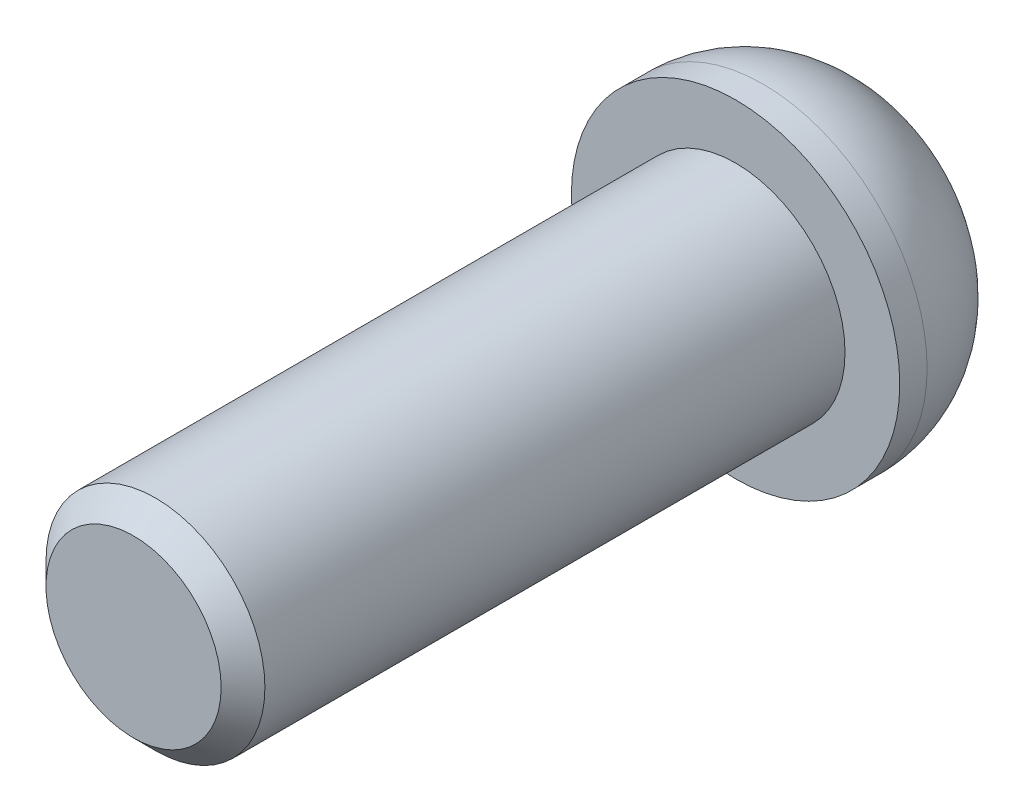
from build123d import *

# Parameters (mm, degrees)
ENLEV_MAT_EXTRU1_DEPTH = 4
ESQUISSE3_W            = 4
ESQUISSE3_H            = 22
CHANFREIN1_SIZE        = 0.8


with BuildPart() as part:
    # Esquisse1 → Base-R_volution (revolve)
    with BuildSketch(Plane(origin=(0, 0, 0), x_dir=(1, 0, 0), z_dir=(0, 1, 0)), mode=Mode.PRIVATE) as base_r_volution_sk:
        with BuildLine():
            Line((0, 0), (6, 0))
            Line((6, 0), (6, 1))
            ThreePointArc((6, 1), (4.681980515, 4.181980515), (1.5, 5.5))
            Line((1.5, 5.5), (0, 5.5))
            Line((0, 5.5), (0, 0))
        make_face()
    revolve(base_r_volution_sk.sketch.rotate(Axis((0, 0, 0), (0, 0, -1)), 180), axis=Axis((0, 0, 0), (0, 0, -1)))

    # Esquisse2 → enlev-mat-Extru1 (cut)
    with BuildSketch(Plane.XY.offset(-5.5)):
        Polygon((3, -1.732050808), (3, 1.732050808), (0, 3.464101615), (-3, 1.732050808), (-3, -1.732050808), (0, -3.464101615), align=None)
    extrude(amount=ENLEV_MAT_EXTRU1_DEPTH, mode=Mode.SUBTRACT)

    # Esquisse3 → Boss.-R_vol.1 (revolve)
    with BuildSketch(Plane(origin=(0, 0, 0), x_dir=(1, 0, 0), z_dir=(0, 1, 0))):
        with Locations((2, -11)):
            Rectangle(ESQUISSE3_W, ESQUISSE3_H)
    revolve(axis=Axis((0, 0, 0), (0, 0, 1)))

    # Chanfrein1
    chanfrein1_edges = [part.edges().sort_by_distance(p)[0] for p in [
        (-4, 0, 22),
    ]]
    chamfer(chanfrein1_edges, length=CHANFREIN1_SIZE)


solid = part.part
